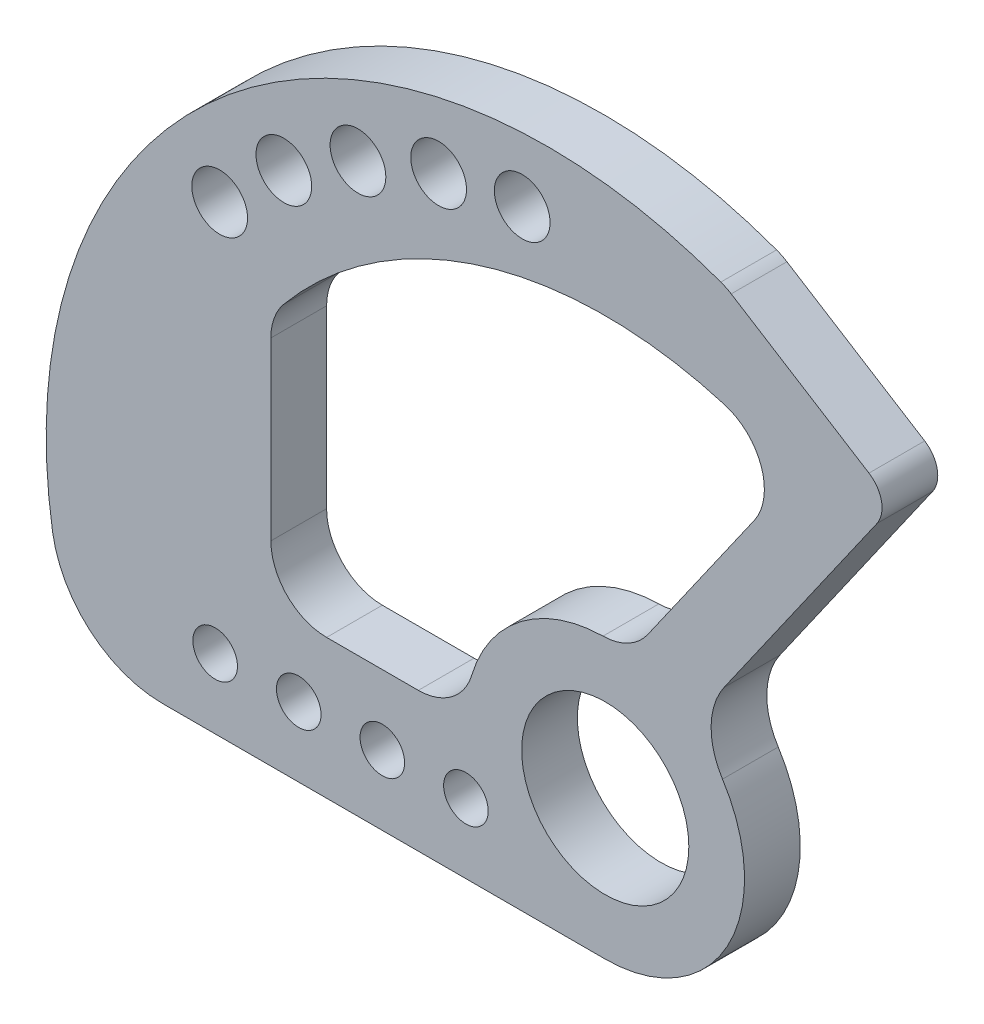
ISO-10303-21;
HEADER;
FILE_DESCRIPTION(('STEP AP214'),'2;1');
FILE_NAME('part.step','',(''),(''),'','','');
FILE_SCHEMA(('AUTOMOTIVE_DESIGN { 1 0 10303 214 1 1 1 1 }'));
ENDSEC;
DATA;
#1=APPLICATION_CONTEXT('core data for automotive mechanical design processes');
#2=APPLICATION_PROTOCOL_DEFINITION('international standard','automotive_design',2000,#1);
#3=PRODUCT_CONTEXT('',#1,'mechanical');
#4=PRODUCT('Part','Part','',(#3));
#5=PRODUCT_RELATED_PRODUCT_CATEGORY('part','',(#4));
#6=PRODUCT_DEFINITION_FORMATION('','',#4);
#7=PRODUCT_DEFINITION_CONTEXT('part definition',#1,'design');
#8=PRODUCT_DEFINITION('design','',#6,#7);
#9=PRODUCT_DEFINITION_SHAPE('','',#8);
#10=(LENGTH_UNIT() NAMED_UNIT(*) SI_UNIT(.MILLI.,.METRE.));
#11=(NAMED_UNIT(*) PLANE_ANGLE_UNIT() SI_UNIT($,.RADIAN.));
#12=(NAMED_UNIT(*) SI_UNIT($,.STERADIAN.) SOLID_ANGLE_UNIT());
#13=UNCERTAINTY_MEASURE_WITH_UNIT(LENGTH_MEASURE(1.E-05),#10,'distance_accuracy_value','');
#14=(GEOMETRIC_REPRESENTATION_CONTEXT(3) GLOBAL_UNCERTAINTY_ASSIGNED_CONTEXT((#13)) GLOBAL_UNIT_ASSIGNED_CONTEXT((#10,
#11,#12)) REPRESENTATION_CONTEXT('',''));
#15=CARTESIAN_POINT('',(0.,0.,0.));
#16=DIRECTION('',(0.,0.,1.));
#17=DIRECTION('',(1.,0.,0.));
#18=AXIS2_PLACEMENT_3D('',#15,#16,#17);
#19=CARTESIAN_POINT('',(46.7163556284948,74.5760156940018,10.));
#20=DIRECTION('',(-0.530867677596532,-0.847454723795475,0.));
#21=DIRECTION('',(0.847454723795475,-0.530867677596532,0.));
#22=AXIS2_PLACEMENT_3D('',#19,#20,#21);
#23=PLANE('',#22);
#24=DIRECTION('',(-0.847454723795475,0.530867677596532,0.));
#25=VECTOR('',#24,1.);
#26=CARTESIAN_POINT('',(46.7163556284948,74.5760156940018,0.));
#27=LINE('',#26,#25);
#28=CARTESIAN_POINT('',(47.3264699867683,74.1938241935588,0.));
#29=VERTEX_POINT('',#28);
#30=CARTESIAN_POINT('',(22.6030603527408,89.6812109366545,0.));
#31=VERTEX_POINT('',#30);
#32=EDGE_CURVE('E257',#29,#31,#27,.T.);
#33=ORIENTED_EDGE('',*,*,#32,.T.);
#34=DIRECTION('',(0.,0.,-1.));
#35=VECTOR('',#34,1.);
#36=CARTESIAN_POINT('',(22.6030603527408,89.6812109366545,10.));
#37=LINE('',#36,#35);
#38=CARTESIAN_POINT('',(22.6030603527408,89.6812109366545,10.));
#39=VERTEX_POINT('',#38);
#40=EDGE_CURVE('E11',#39,#31,#37,.T.);
#41=ORIENTED_EDGE('',*,*,#40,.F.);
#42=DIRECTION('',(-0.847454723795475,0.530867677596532,0.));
#43=VECTOR('',#42,1.);
#44=CARTESIAN_POINT('',(46.7163556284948,74.5760156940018,10.));
#45=LINE('',#44,#43);
#46=CARTESIAN_POINT('',(47.3264699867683,74.1938241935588,10.));
#47=VERTEX_POINT('',#46);
#48=EDGE_CURVE('E385',#47,#39,#45,.T.);
#49=ORIENTED_EDGE('',*,*,#48,.F.);
#50=DIRECTION('',(0.,0.,-1.));
#51=VECTOR('',#50,1.);
#52=CARTESIAN_POINT('',(47.3264699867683,74.1938241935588,10.));
#53=LINE('',#52,#51);
#54=EDGE_CURVE('E279',#47,#29,#53,.T.);
#55=ORIENTED_EDGE('',*,*,#54,.T.);
#56=EDGE_LOOP('',(#33,#41,#49,#55));
#57=FACE_BOUND('',#56,.T.);
#58=ADVANCED_FACE('F35',(#57),#23,.F.);
#59=CARTESIAN_POINT('',(17.2943835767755,81.2066636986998,10.));
#60=DIRECTION('',(0.,0.,-1.));
#61=DIRECTION('',(-1.,0.,0.));
#62=AXIS2_PLACEMENT_3D('',#59,#60,#61);
#63=CYLINDRICAL_SURFACE('',#62,9.99999999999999);
#64=CARTESIAN_POINT('',(17.2943835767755,81.2066636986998,0.));
#65=DIRECTION('',(0.,0.,1.));
#66=DIRECTION('',(1.,0.,0.));
#67=AXIS2_PLACEMENT_3D('',#64,#65,#66);
#68=CIRCLE('',#67,9.99999999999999);
#69=CARTESIAN_POINT('',(20.7461687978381,90.5920341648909,0.));
#70=VERTEX_POINT('',#69);
#71=EDGE_CURVE('E260',#31,#70,#68,.T.);
#72=ORIENTED_EDGE('',*,*,#71,.T.);
#73=DIRECTION('',(0.,0.,-1.));
#74=VECTOR('',#73,1.);
#75=CARTESIAN_POINT('',(20.7461687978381,90.5920341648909,10.));
#76=LINE('',#75,#74);
#77=CARTESIAN_POINT('',(20.7461687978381,90.5920341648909,10.));
#78=VERTEX_POINT('',#77);
#79=EDGE_CURVE('E45',#78,#70,#76,.T.);
#80=ORIENTED_EDGE('',*,*,#79,.F.);
#81=CARTESIAN_POINT('',(17.2943835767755,81.2066636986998,10.));
#82=DIRECTION('',(0.,0.,1.));
#83=DIRECTION('',(1.,0.,0.));
#84=AXIS2_PLACEMENT_3D('',#81,#82,#83);
#85=CIRCLE('',#84,9.99999999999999);
#86=EDGE_CURVE('E387',#39,#78,#85,.T.);
#87=ORIENTED_EDGE('',*,*,#86,.F.);
#88=ORIENTED_EDGE('',*,*,#40,.T.);
#89=EDGE_LOOP('',(#72,#80,#87,#88));
#90=FACE_BOUND('',#89,.T.);
#91=ADVANCED_FACE('F421',(#90),#63,.T.);
#92=CARTESIAN_POINT('',(-10.3198981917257,6.12369996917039,10.));
#93=DIRECTION('',(0.,0.,-1.));
#94=DIRECTION('',(-1.,0.,0.));
#95=AXIS2_PLACEMENT_3D('',#92,#93,#94);
#96=CYLINDRICAL_SURFACE('',#95,90.);
#97=CARTESIAN_POINT('',(-10.3198981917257,6.12369996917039,0.));
#98=DIRECTION('',(0.,0.,1.));
#99=DIRECTION('',(1.,0.,0.));
#100=AXIS2_PLACEMENT_3D('',#97,#98,#99);
#101=CIRCLE('',#100,90.);
#102=CARTESIAN_POINT('',(-99.176274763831,-8.17819999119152,0.));
#103=VERTEX_POINT('',#102);
#104=EDGE_CURVE('E262',#70,#103,#101,.T.);
#105=ORIENTED_EDGE('',*,*,#104,.T.);
#106=DIRECTION('',(0.,0.,-1.));
#107=VECTOR('',#106,1.);
#108=CARTESIAN_POINT('',(-99.176274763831,-8.17819999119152,10.));
#109=LINE('',#108,#107);
#110=CARTESIAN_POINT('',(-99.176274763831,-8.17819999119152,10.));
#111=VERTEX_POINT('',#110);
#112=EDGE_CURVE('E287',#111,#103,#109,.T.);
#113=ORIENTED_EDGE('',*,*,#112,.F.);
#114=CARTESIAN_POINT('',(-10.3198981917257,6.12369996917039,10.));
#115=DIRECTION('',(0.,0.,1.));
#116=DIRECTION('',(1.,0.,0.));
#117=AXIS2_PLACEMENT_3D('',#114,#115,#116);
#118=CIRCLE('',#117,90.);
#119=EDGE_CURVE('E389',#78,#111,#118,.T.);
#120=ORIENTED_EDGE('',*,*,#119,.F.);
#121=ORIENTED_EDGE('',*,*,#79,.T.);
#122=EDGE_LOOP('',(#105,#113,#120,#121));
#123=FACE_BOUND('',#122,.T.);
#124=ADVANCED_FACE('F427',(#123),#96,.T.);
#125=CARTESIAN_POINT('',(-79.4304133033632,-5.00000000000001,10.));
#126=DIRECTION('',(0.,0.,-1.));
#127=DIRECTION('',(-1.,0.,0.));
#128=AXIS2_PLACEMENT_3D('',#125,#126,#127);
#129=CYLINDRICAL_SURFACE('',#128,20.);
#130=CARTESIAN_POINT('',(-79.4304133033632,-5.00000000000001,0.));
#131=DIRECTION('',(0.,0.,1.));
#132=DIRECTION('',(1.,0.,0.));
#133=AXIS2_PLACEMENT_3D('',#130,#131,#132);
#134=CIRCLE('',#133,20.);
#135=CARTESIAN_POINT('',(-79.4304133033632,-25.,0.));
#136=VERTEX_POINT('',#135);
#137=EDGE_CURVE('E264',#103,#136,#134,.T.);
#138=ORIENTED_EDGE('',*,*,#137,.T.);
#139=DIRECTION('',(0.,0.,-1.));
#140=VECTOR('',#139,1.);
#141=CARTESIAN_POINT('',(-79.4304133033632,-25.,10.));
#142=LINE('',#141,#140);
#143=CARTESIAN_POINT('',(-79.4304133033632,-25.,10.));
#144=VERTEX_POINT('',#143);
#145=EDGE_CURVE('E285',#144,#136,#142,.T.);
#146=ORIENTED_EDGE('',*,*,#145,.F.);
#147=CARTESIAN_POINT('',(-79.4304133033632,-5.00000000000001,10.));
#148=DIRECTION('',(0.,0.,1.));
#149=DIRECTION('',(1.,0.,0.));
#150=AXIS2_PLACEMENT_3D('',#147,#148,#149);
#151=CIRCLE('',#150,20.);
#152=EDGE_CURVE('E391',#111,#144,#151,.T.);
#153=ORIENTED_EDGE('',*,*,#152,.F.);
#154=ORIENTED_EDGE('',*,*,#112,.T.);
#155=EDGE_LOOP('',(#138,#146,#153,#154));
#156=FACE_BOUND('',#155,.T.);
#157=ADVANCED_FACE('F403',(#156),#129,.T.);
#158=CARTESIAN_POINT('',(0.,-25.,10.));
#159=DIRECTION('',(0.,-1.,0.));
#160=DIRECTION('',(1.,0.,0.));
#161=AXIS2_PLACEMENT_3D('',#158,#159,#160);
#162=PLANE('',#161);
#163=DIRECTION('',(-1.,0.,0.));
#164=VECTOR('',#163,1.);
#165=CARTESIAN_POINT('',(0.,-25.,0.));
#166=LINE('',#165,#164);
#167=CARTESIAN_POINT('',(0.,-25.,0.));
#168=VERTEX_POINT('',#167);
#169=EDGE_CURVE('E267',#168,#136,#166,.T.);
#170=ORIENTED_EDGE('',*,*,#169,.F.);
#171=DIRECTION('',(0.,0.,-1.));
#172=VECTOR('',#171,1.);
#173=CARTESIAN_POINT('',(0.,-25.,10.));
#174=LINE('',#173,#172);
#175=CARTESIAN_POINT('',(0.,-25.,10.));
#176=VERTEX_POINT('',#175);
#177=EDGE_CURVE('E283',#176,#168,#174,.T.);
#178=ORIENTED_EDGE('',*,*,#177,.F.);
#179=DIRECTION('',(-1.,0.,0.));
#180=VECTOR('',#179,1.);
#181=CARTESIAN_POINT('',(0.,-25.,10.));
#182=LINE('',#181,#180);
#183=EDGE_CURVE('E393',#176,#144,#182,.T.);
#184=ORIENTED_EDGE('',*,*,#183,.T.);
#185=ORIENTED_EDGE('',*,*,#145,.T.);
#186=EDGE_LOOP('',(#170,#178,#184,#185));
#187=FACE_BOUND('',#186,.T.);
#188=ADVANCED_FACE('F397',(#187),#162,.T.);
#189=CARTESIAN_POINT('',(0.,0.,10.));
#190=DIRECTION('',(0.,0.,-1.));
#191=DIRECTION('',(-1.,0.,0.));
#192=AXIS2_PLACEMENT_3D('',#189,#190,#191);
#193=CYLINDRICAL_SURFACE('',#192,25.);
#194=CARTESIAN_POINT('',(0.,0.,0.));
#195=DIRECTION('',(0.,0.,1.));
#196=DIRECTION('',(1.,0.,0.));
#197=AXIS2_PLACEMENT_3D('',#194,#195,#196);
#198=CIRCLE('',#197,25.);
#199=CARTESIAN_POINT('',(21.0450044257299,13.4947318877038,0.));
#200=VERTEX_POINT('',#199);
#201=EDGE_CURVE('E270',#168,#200,#198,.T.);
#202=ORIENTED_EDGE('',*,*,#201,.T.);
#203=DIRECTION('',(0.,0.,-1.));
#204=VECTOR('',#203,1.);
#205=CARTESIAN_POINT('',(21.0450044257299,13.4947318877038,10.));
#206=LINE('',#205,#204);
#207=CARTESIAN_POINT('',(21.0450044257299,13.4947318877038,10.));
#208=VERTEX_POINT('',#207);
#209=EDGE_CURVE('E195',#208,#200,#206,.T.);
#210=ORIENTED_EDGE('',*,*,#209,.F.);
#211=CARTESIAN_POINT('',(0.,0.,10.));
#212=DIRECTION('',(0.,0.,1.));
#213=DIRECTION('',(1.,0.,0.));
#214=AXIS2_PLACEMENT_3D('',#211,#212,#213);
#215=CIRCLE('',#214,25.);
#216=EDGE_CURVE('E186',#176,#208,#215,.T.);
#217=ORIENTED_EDGE('',*,*,#216,.F.);
#218=ORIENTED_EDGE('',*,*,#177,.T.);
#219=EDGE_LOOP('',(#202,#210,#217,#218));
#220=FACE_BOUND('',#219,.T.);
#221=ADVANCED_FACE('F411',(#220),#193,.T.);
#222=CARTESIAN_POINT('',(31.948131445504,20.4861666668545,10.));
#223=DIRECTION('',(0.,0.,-1.));
#224=DIRECTION('',(-1.,0.,0.));
#225=AXIS2_PLACEMENT_3D('',#222,#223,#224);
#226=CYLINDRICAL_SURFACE('',#225,12.9521557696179);
#227=CARTESIAN_POINT('',(31.948131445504,20.4861666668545,0.));
#228=DIRECTION('',(0.,0.,1.));
#229=DIRECTION('',(1.,0.,0.));
#230=AXIS2_PLACEMENT_3D('',#227,#228,#229);
#231=CIRCLE('',#230,12.9521557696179);
#232=CARTESIAN_POINT('',(21.338346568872,27.9152180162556,0.));
#233=VERTEX_POINT('',#232);
#234=EDGE_CURVE('E194',#200,#233,#231,.F.);
#235=ORIENTED_EDGE('',*,*,#234,.T.);
#236=DIRECTION('',(0.,0.,-1.));
#237=VECTOR('',#236,1.);
#238=CARTESIAN_POINT('',(21.338346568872,27.9152180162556,10.));
#239=LINE('',#238,#237);
#240=CARTESIAN_POINT('',(21.338346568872,27.9152180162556,10.));
#241=VERTEX_POINT('',#240);
#242=EDGE_CURVE('E191',#241,#233,#239,.T.);
#243=ORIENTED_EDGE('',*,*,#242,.F.);
#244=CARTESIAN_POINT('',(31.948131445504,20.4861666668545,10.));
#245=DIRECTION('',(0.,0.,1.));
#246=DIRECTION('',(1.,0.,0.));
#247=AXIS2_PLACEMENT_3D('',#244,#245,#246);
#248=CIRCLE('',#247,12.9521557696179);
#249=EDGE_CURVE('E178',#208,#241,#248,.F.);
#250=ORIENTED_EDGE('',*,*,#249,.F.);
#251=ORIENTED_EDGE('',*,*,#209,.T.);
#252=EDGE_LOOP('',(#235,#243,#250,#251));
#253=FACE_BOUND('',#252,.T.);
#254=ADVANCED_FACE('F192',(#253),#226,.F.);
#255=CARTESIAN_POINT('',(1.20238327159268,-0.841917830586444,10.));
#256=DIRECTION('',(-0.819152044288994,0.573576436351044,0.));
#257=DIRECTION('',(-0.573576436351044,-0.819152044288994,0.));
#258=AXIS2_PLACEMENT_3D('',#255,#256,#257);
#259=PLANE('',#258);
#260=DIRECTION('',(0.573576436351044,0.819152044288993,0.));
#261=VECTOR('',#260,1.);
#262=CARTESIAN_POINT('',(1.20238327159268,-0.841917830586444,0.));
#263=LINE('',#262,#261);
#264=CARTESIAN_POINT('',(48.7678918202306,67.0886683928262,0.));
#265=VERTEX_POINT('',#264);
#266=EDGE_CURVE('E116',#233,#265,#263,.T.);
#267=ORIENTED_EDGE('',*,*,#266,.T.);
#268=DIRECTION('',(0.,0.,-1.));
#269=VECTOR('',#268,1.);
#270=CARTESIAN_POINT('',(48.7678918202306,67.0886683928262,10.));
#271=LINE('',#270,#269);
#272=CARTESIAN_POINT('',(48.7678918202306,67.0886683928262,10.));
#273=VERTEX_POINT('',#272);
#274=EDGE_CURVE('E196',#273,#265,#271,.T.);
#275=ORIENTED_EDGE('',*,*,#274,.F.);
#276=DIRECTION('',(0.573576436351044,0.819152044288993,0.));
#277=VECTOR('',#276,1.);
#278=CARTESIAN_POINT('',(1.20238327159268,-0.841917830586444,10.));
#279=LINE('',#278,#277);
#280=EDGE_CURVE('E183',#241,#273,#279,.T.);
#281=ORIENTED_EDGE('',*,*,#280,.F.);
#282=ORIENTED_EDGE('',*,*,#242,.T.);
#283=EDGE_LOOP('',(#267,#275,#281,#282));
#284=FACE_BOUND('',#283,.T.);
#285=ADVANCED_FACE('F198',(#284),#259,.F.);
#286=CARTESIAN_POINT('',(-0.561025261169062,34.9955032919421,10.));
#287=DIRECTION('',(0.,0.,-1.));
#288=DIRECTION('',(-1.,0.,0.));
#289=AXIS2_PLACEMENT_3D('',#286,#287,#288);
#290=CYLINDRICAL_SURFACE('',#289,9.99999999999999);
#291=CARTESIAN_POINT('',(-0.561025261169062,34.9955032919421,0.));
#292=DIRECTION('',(0.,0.,1.));
#293=DIRECTION('',(1.,0.,0.));
#294=AXIS2_PLACEMENT_3D('',#291,#292,#293);
#295=CIRCLE('',#294,9.99999999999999);
#296=CARTESIAN_POINT('',(7.63049518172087,29.2597389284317,0.));
#297=VERTEX_POINT('',#296);
#298=CARTESIAN_POINT('',(-0.400732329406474,24.9967880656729,0.));
#299=VERTEX_POINT('',#298);
#300=EDGE_CURVE('E207',#297,#299,#295,.F.);
#301=ORIENTED_EDGE('',*,*,#300,.T.);
#302=DIRECTION('',(0.,0.,-1.));
#303=VECTOR('',#302,1.);
#304=CARTESIAN_POINT('',(-0.400732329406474,24.9967880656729,10.));
#305=LINE('',#304,#303);
#306=CARTESIAN_POINT('',(-0.400732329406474,24.9967880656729,10.));
#307=VERTEX_POINT('',#306);
#308=EDGE_CURVE('E39',#307,#299,#305,.T.);
#309=ORIENTED_EDGE('',*,*,#308,.F.);
#310=CARTESIAN_POINT('',(-0.561025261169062,34.9955032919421,10.));
#311=DIRECTION('',(0.,0.,1.));
#312=DIRECTION('',(1.,0.,0.));
#313=AXIS2_PLACEMENT_3D('',#310,#311,#312);
#314=CIRCLE('',#313,9.99999999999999);
#315=CARTESIAN_POINT('',(7.63049518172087,29.2597389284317,10.));
#316=VERTEX_POINT('',#315);
#317=EDGE_CURVE('E278',#316,#307,#314,.F.);
#318=ORIENTED_EDGE('',*,*,#317,.F.);
#319=DIRECTION('',(0.,0.,-1.));
#320=VECTOR('',#319,1.);
#321=CARTESIAN_POINT('',(7.63049518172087,29.2597389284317,10.));
#322=LINE('',#321,#320);
#323=EDGE_CURVE('E206',#316,#297,#322,.T.);
#324=ORIENTED_EDGE('',*,*,#323,.T.);
#325=EDGE_LOOP('',(#301,#309,#318,#324));
#326=FACE_BOUND('',#325,.T.);
#327=ADVANCED_FACE('F37',(#326),#290,.F.);
#328=CARTESIAN_POINT('',(0.,0.,10.));
#329=DIRECTION('',(0.,0.,-1.));
#330=DIRECTION('',(-1.,0.,0.));
#331=AXIS2_PLACEMENT_3D('',#328,#329,#330);
#332=CYLINDRICAL_SURFACE('',#331,25.);
#333=CARTESIAN_POINT('',(0.,0.,0.));
#334=DIRECTION('',(0.,0.,1.));
#335=DIRECTION('',(1.,0.,0.));
#336=AXIS2_PLACEMENT_3D('',#333,#334,#335);
#337=CIRCLE('',#336,25.);
#338=CARTESIAN_POINT('',(-23.9578711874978,7.14285714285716,0.));
#339=VERTEX_POINT('',#338);
#340=EDGE_CURVE('E210',#299,#339,#337,.T.);
#341=ORIENTED_EDGE('',*,*,#340,.T.);
#342=DIRECTION('',(0.,0.,-1.));
#343=VECTOR('',#342,1.);
#344=CARTESIAN_POINT('',(-23.9578711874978,7.14285714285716,10.));
#345=LINE('',#344,#343);
#346=CARTESIAN_POINT('',(-23.9578711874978,7.14285714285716,10.));
#347=VERTEX_POINT('',#346);
#348=EDGE_CURVE('E313',#347,#339,#345,.T.);
#349=ORIENTED_EDGE('',*,*,#348,.F.);
#350=CARTESIAN_POINT('',(0.,0.,10.));
#351=DIRECTION('',(0.,0.,1.));
#352=DIRECTION('',(1.,0.,0.));
#353=AXIS2_PLACEMENT_3D('',#350,#351,#352);
#354=CIRCLE('',#353,25.);
#355=EDGE_CURVE('E131',#307,#347,#354,.T.);
#356=ORIENTED_EDGE('',*,*,#355,.F.);
#357=ORIENTED_EDGE('',*,*,#308,.T.);
#358=EDGE_LOOP('',(#341,#349,#356,#357));
#359=FACE_BOUND('',#358,.T.);
#360=ADVANCED_FACE('F318',(#359),#332,.T.);
#361=CARTESIAN_POINT('',(-33.5410196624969,10.,10.));
#362=DIRECTION('',(0.,0.,-1.));
#363=DIRECTION('',(-1.,0.,0.));
#364=AXIS2_PLACEMENT_3D('',#361,#362,#363);
#365=CYLINDRICAL_SURFACE('',#364,10.);
#366=CARTESIAN_POINT('',(-33.5410196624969,10.,0.));
#367=DIRECTION('',(0.,0.,1.));
#368=DIRECTION('',(1.,0.,0.));
#369=AXIS2_PLACEMENT_3D('',#366,#367,#368);
#370=CIRCLE('',#369,10.);
#371=CARTESIAN_POINT('',(-33.5410196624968,0.,0.));
#372=VERTEX_POINT('',#371);
#373=EDGE_CURVE('E213',#372,#339,#370,.T.);
#374=ORIENTED_EDGE('',*,*,#373,.F.);
#375=DIRECTION('',(0.,0.,-1.));
#376=VECTOR('',#375,1.);
#377=CARTESIAN_POINT('',(-33.5410196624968,0.,10.));
#378=LINE('',#377,#376);
#379=CARTESIAN_POINT('',(-33.5410196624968,0.,10.));
#380=VERTEX_POINT('',#379);
#381=EDGE_CURVE('E312',#380,#372,#378,.T.);
#382=ORIENTED_EDGE('',*,*,#381,.F.);
#383=CARTESIAN_POINT('',(-33.5410196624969,10.,10.));
#384=DIRECTION('',(0.,0.,1.));
#385=DIRECTION('',(1.,0.,0.));
#386=AXIS2_PLACEMENT_3D('',#383,#384,#385);
#387=CIRCLE('',#386,10.);
#388=EDGE_CURVE('E333',#380,#347,#387,.T.);
#389=ORIENTED_EDGE('',*,*,#388,.T.);
#390=ORIENTED_EDGE('',*,*,#348,.T.);
#391=EDGE_LOOP('',(#374,#382,#389,#390));
#392=FACE_BOUND('',#391,.T.);
#393=ADVANCED_FACE('F330',(#392),#365,.F.);
#394=CARTESIAN_POINT('',(0.,0.,10.));
#395=DIRECTION('',(0.,-1.,0.));
#396=DIRECTION('',(1.,0.,0.));
#397=AXIS2_PLACEMENT_3D('',#394,#395,#396);
#398=PLANE('',#397);
#399=DIRECTION('',(-1.,0.,0.));
#400=VECTOR('',#399,1.);
#401=CARTESIAN_POINT('',(0.,0.,0.));
#402=LINE('',#401,#400);
#403=CARTESIAN_POINT('',(-50.,0.,0.));
#404=VERTEX_POINT('',#403);
#405=EDGE_CURVE('E216',#372,#404,#402,.T.);
#406=ORIENTED_EDGE('',*,*,#405,.T.);
#407=DIRECTION('',(0.,0.,-1.));
#408=VECTOR('',#407,1.);
#409=CARTESIAN_POINT('',(-50.,0.,10.));
#410=LINE('',#409,#408);
#411=CARTESIAN_POINT('',(-50.,0.,10.));
#412=VERTEX_POINT('',#411);
#413=EDGE_CURVE('E309',#412,#404,#410,.T.);
#414=ORIENTED_EDGE('',*,*,#413,.F.);
#415=DIRECTION('',(-1.,0.,0.));
#416=VECTOR('',#415,1.);
#417=CARTESIAN_POINT('',(0.,0.,10.));
#418=LINE('',#417,#416);
#419=EDGE_CURVE('E336',#380,#412,#418,.T.);
#420=ORIENTED_EDGE('',*,*,#419,.F.);
#421=ORIENTED_EDGE('',*,*,#381,.T.);
#422=EDGE_LOOP('',(#406,#414,#420,#421));
#423=FACE_BOUND('',#422,.T.);
#424=ADVANCED_FACE('F337',(#423),#398,.F.);
#425=CARTESIAN_POINT('',(-50.,10.,10.));
#426=DIRECTION('',(0.,0.,-1.));
#427=DIRECTION('',(-1.,0.,0.));
#428=AXIS2_PLACEMENT_3D('',#425,#426,#427);
#429=CYLINDRICAL_SURFACE('',#428,10.);
#430=CARTESIAN_POINT('',(-50.,10.,0.));
#431=DIRECTION('',(0.,0.,1.));
#432=DIRECTION('',(1.,0.,0.));
#433=AXIS2_PLACEMENT_3D('',#430,#431,#432);
#434=CIRCLE('',#433,10.);
#435=CARTESIAN_POINT('',(-60.,10.,0.));
#436=VERTEX_POINT('',#435);
#437=EDGE_CURVE('E218',#404,#436,#434,.F.);
#438=ORIENTED_EDGE('',*,*,#437,.T.);
#439=DIRECTION('',(0.,0.,-1.));
#440=VECTOR('',#439,1.);
#441=CARTESIAN_POINT('',(-60.,10.,10.));
#442=LINE('',#441,#440);
#443=CARTESIAN_POINT('',(-60.,10.,10.));
#444=VERTEX_POINT('',#443);
#445=EDGE_CURVE('E306',#444,#436,#442,.T.);
#446=ORIENTED_EDGE('',*,*,#445,.F.);
#447=CARTESIAN_POINT('',(-50.,10.,10.));
#448=DIRECTION('',(0.,0.,1.));
#449=DIRECTION('',(1.,0.,0.));
#450=AXIS2_PLACEMENT_3D('',#447,#448,#449);
#451=CIRCLE('',#450,10.);
#452=EDGE_CURVE('E340',#412,#444,#451,.F.);
#453=ORIENTED_EDGE('',*,*,#452,.F.);
#454=ORIENTED_EDGE('',*,*,#413,.T.);
#455=EDGE_LOOP('',(#438,#446,#453,#454));
#456=FACE_BOUND('',#455,.T.);
#457=ADVANCED_FACE('F489',(#456),#429,.F.);
#458=CARTESIAN_POINT('',(-60.,0.,10.));
#459=DIRECTION('',(-1.,0.,0.));
#460=DIRECTION('',(0.,0.,1.));
#461=AXIS2_PLACEMENT_3D('',#458,#459,#460);
#462=PLANE('',#461);
#463=DIRECTION('',(0.,1.,0.));
#464=VECTOR('',#463,1.);
#465=CARTESIAN_POINT('',(-60.,0.,0.));
#466=LINE('',#465,#464);
#467=CARTESIAN_POINT('',(-60.,41.5331193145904,0.));
#468=VERTEX_POINT('',#467);
#469=EDGE_CURVE('E220',#436,#468,#466,.T.);
#470=ORIENTED_EDGE('',*,*,#469,.T.);
#471=DIRECTION('',(0.,0.,-1.));
#472=VECTOR('',#471,1.);
#473=CARTESIAN_POINT('',(-60.,41.5331193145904,10.));
#474=LINE('',#473,#472);
#475=CARTESIAN_POINT('',(-60.,41.5331193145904,10.));
#476=VERTEX_POINT('',#475);
#477=EDGE_CURVE('E303',#476,#468,#474,.T.);
#478=ORIENTED_EDGE('',*,*,#477,.F.);
#479=DIRECTION('',(0.,1.,0.));
#480=VECTOR('',#479,1.);
#481=CARTESIAN_POINT('',(-60.,0.,10.));
#482=LINE('',#481,#480);
#483=EDGE_CURVE('E348',#444,#476,#482,.T.);
#484=ORIENTED_EDGE('',*,*,#483,.F.);
#485=ORIENTED_EDGE('',*,*,#445,.T.);
#486=EDGE_LOOP('',(#470,#478,#484,#485));
#487=FACE_BOUND('',#486,.T.);
#488=ADVANCED_FACE('F485',(#487),#462,.F.);
#489=CARTESIAN_POINT('',(-50.,41.5331193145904,10.));
#490=DIRECTION('',(0.,0.,-1.));
#491=DIRECTION('',(-1.,0.,0.));
#492=AXIS2_PLACEMENT_3D('',#489,#490,#491);
#493=CYLINDRICAL_SURFACE('',#492,9.99999999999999);
#494=CARTESIAN_POINT('',(-50.,41.5331193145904,0.));
#495=DIRECTION('',(0.,0.,1.));
#496=DIRECTION('',(1.,0.,0.));
#497=AXIS2_PLACEMENT_3D('',#494,#495,#496);
#498=CIRCLE('',#497,9.99999999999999);
#499=CARTESIAN_POINT('',(-57.6923076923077,47.9228299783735,0.));
#500=VERTEX_POINT('',#499);
#501=EDGE_CURVE('E222',#468,#500,#498,.F.);
#502=ORIENTED_EDGE('',*,*,#501,.T.);
#503=DIRECTION('',(0.,0.,-1.));
#504=VECTOR('',#503,1.);
#505=CARTESIAN_POINT('',(-57.6923076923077,47.9228299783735,10.));
#506=LINE('',#505,#504);
#507=CARTESIAN_POINT('',(-57.6923076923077,47.9228299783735,10.));
#508=VERTEX_POINT('',#507);
#509=EDGE_CURVE('E300',#508,#500,#506,.T.);
#510=ORIENTED_EDGE('',*,*,#509,.F.);
#511=CARTESIAN_POINT('',(-50.,41.5331193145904,10.));
#512=DIRECTION('',(0.,0.,1.));
#513=DIRECTION('',(1.,0.,0.));
#514=AXIS2_PLACEMENT_3D('',#511,#512,#513);
#515=CIRCLE('',#514,9.99999999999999);
#516=EDGE_CURVE('E350',#476,#508,#515,.F.);
#517=ORIENTED_EDGE('',*,*,#516,.F.);
#518=ORIENTED_EDGE('',*,*,#477,.T.);
#519=EDGE_LOOP('',(#502,#510,#517,#518));
#520=FACE_BOUND('',#519,.T.);
#521=ADVANCED_FACE('F481',(#520),#493,.F.);
#522=CARTESIAN_POINT('',(0.,0.,10.));
#523=DIRECTION('',(0.,0.,-1.));
#524=DIRECTION('',(-1.,0.,0.));
#525=AXIS2_PLACEMENT_3D('',#522,#523,#524);
#526=CYLINDRICAL_SURFACE('',#525,75.);
#527=CARTESIAN_POINT('',(0.,0.,0.));
#528=DIRECTION('',(0.,0.,1.));
#529=DIRECTION('',(1.,0.,0.));
#530=AXIS2_PLACEMENT_3D('',#527,#528,#529);
#531=CIRCLE('',#530,75.);
#532=CARTESIAN_POINT('',(21.4091769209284,71.8793930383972,0.));
#533=VERTEX_POINT('',#532);
#534=EDGE_CURVE('E224',#500,#533,#531,.F.);
#535=ORIENTED_EDGE('',*,*,#534,.T.);
#536=DIRECTION('',(0.,0.,-1.));
#537=VECTOR('',#536,1.);
#538=CARTESIAN_POINT('',(21.4091769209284,71.8793930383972,10.));
#539=LINE('',#538,#537);
#540=CARTESIAN_POINT('',(21.4091769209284,71.8793930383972,10.));
#541=VERTEX_POINT('',#540);
#542=EDGE_CURVE('E297',#541,#533,#539,.T.);
#543=ORIENTED_EDGE('',*,*,#542,.F.);
#544=CARTESIAN_POINT('',(0.,0.,10.));
#545=DIRECTION('',(0.,0.,1.));
#546=DIRECTION('',(1.,0.,0.));
#547=AXIS2_PLACEMENT_3D('',#544,#545,#546);
#548=CIRCLE('',#547,75.);
#549=EDGE_CURVE('E352',#508,#541,#548,.F.);
#550=ORIENTED_EDGE('',*,*,#549,.F.);
#551=ORIENTED_EDGE('',*,*,#509,.T.);
#552=EDGE_LOOP('',(#535,#543,#550,#551));
#553=FACE_BOUND('',#552,.T.);
#554=ADVANCED_FACE('F477',(#553),#526,.F.);
#555=CARTESIAN_POINT('',(18.5546199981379,62.2954739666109,10.));
#556=DIRECTION('',(0.,0.,-1.));
#557=DIRECTION('',(-1.,0.,0.));
#558=AXIS2_PLACEMENT_3D('',#555,#556,#557);
#559=CYLINDRICAL_SURFACE('',#558,9.99999999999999);
#560=CARTESIAN_POINT('',(18.5546199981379,62.2954739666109,0.));
#561=DIRECTION('',(0.,0.,1.));
#562=DIRECTION('',(1.,0.,0.));
#563=AXIS2_PLACEMENT_3D('',#560,#561,#562);
#564=CIRCLE('',#563,9.99999999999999);
#565=CARTESIAN_POINT('',(26.7461404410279,56.5597096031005,0.));
#566=VERTEX_POINT('',#565);
#567=EDGE_CURVE('E226',#533,#566,#564,.F.);
#568=ORIENTED_EDGE('',*,*,#567,.T.);
#569=DIRECTION('',(0.,0.,-1.));
#570=VECTOR('',#569,1.);
#571=CARTESIAN_POINT('',(26.7461404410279,56.5597096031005,10.));
#572=LINE('',#571,#570);
#573=CARTESIAN_POINT('',(26.7461404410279,56.5597096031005,10.));
#574=VERTEX_POINT('',#573);
#575=EDGE_CURVE('E294',#574,#566,#572,.T.);
#576=ORIENTED_EDGE('',*,*,#575,.F.);
#577=CARTESIAN_POINT('',(18.5546199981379,62.2954739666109,10.));
#578=DIRECTION('',(0.,0.,1.));
#579=DIRECTION('',(1.,0.,0.));
#580=AXIS2_PLACEMENT_3D('',#577,#578,#579);
#581=CIRCLE('',#580,9.99999999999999);
#582=EDGE_CURVE('E354',#541,#574,#581,.F.);
#583=ORIENTED_EDGE('',*,*,#582,.F.);
#584=ORIENTED_EDGE('',*,*,#542,.T.);
#585=EDGE_LOOP('',(#568,#576,#583,#584));
#586=FACE_BOUND('',#585,.T.);
#587=ADVANCED_FACE('F474',(#586),#559,.F.);
#588=CARTESIAN_POINT('',(44.6721315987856,69.9565505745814,10.));
#589=DIRECTION('',(0.,0.,-1.));
#590=DIRECTION('',(-1.,0.,0.));
#591=AXIS2_PLACEMENT_3D('',#588,#589,#590);
#592=CYLINDRICAL_SURFACE('',#591,5.);
#593=CARTESIAN_POINT('',(44.6721315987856,69.9565505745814,0.));
#594=DIRECTION('',(0.,0.,1.));
#595=DIRECTION('',(1.,0.,0.));
#596=AXIS2_PLACEMENT_3D('',#593,#594,#595);
#597=CIRCLE('',#596,5.);
#598=EDGE_CURVE('E122',#265,#29,#597,.T.);
#599=ORIENTED_EDGE('',*,*,#598,.T.);
#600=ORIENTED_EDGE('',*,*,#54,.F.);
#601=CARTESIAN_POINT('',(44.6721315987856,69.9565505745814,10.));
#602=DIRECTION('',(0.,0.,1.));
#603=DIRECTION('',(1.,0.,0.));
#604=AXIS2_PLACEMENT_3D('',#601,#602,#603);
#605=CIRCLE('',#604,5.);
#606=EDGE_CURVE('E54',#273,#47,#605,.T.);
#607=ORIENTED_EDGE('',*,*,#606,.F.);
#608=ORIENTED_EDGE('',*,*,#274,.T.);
#609=EDGE_LOOP('',(#599,#600,#607,#608));
#610=FACE_BOUND('',#609,.T.);
#611=ADVANCED_FACE('F436',(#610),#592,.T.);
#612=CARTESIAN_POINT('',(-25.,-12.5,10.));
#613=DIRECTION('',(0.,0.,-1.));
#614=DIRECTION('',(-1.,0.,0.));
#615=AXIS2_PLACEMENT_3D('',#612,#613,#614);
#616=CYLINDRICAL_SURFACE('',#615,4.00000000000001);
#617=CARTESIAN_POINT('',(-25.,-12.5,10.));
#618=DIRECTION('',(0.,0.,1.));
#619=DIRECTION('',(1.,0.,0.));
#620=AXIS2_PLACEMENT_3D('',#617,#618,#619);
#621=CIRCLE('',#620,4.00000000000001);
#622=CARTESIAN_POINT('',(-21.,-12.5,10.));
#623=VERTEX_POINT('',#622);
#624=EDGE_CURVE('E382',#623,#623,#621,.T.);
#625=ORIENTED_EDGE('',*,*,#624,.T.);
#626=EDGE_LOOP('',(#625));
#627=FACE_BOUND('',#626,.T.);
#628=CARTESIAN_POINT('',(-25.,-12.5,0.));
#629=DIRECTION('',(0.,0.,1.));
#630=DIRECTION('',(1.,0.,0.));
#631=AXIS2_PLACEMENT_3D('',#628,#629,#630);
#632=CIRCLE('',#631,4.00000000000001);
#633=CARTESIAN_POINT('',(-21.,-12.5,0.));
#634=VERTEX_POINT('',#633);
#635=EDGE_CURVE('E254',#634,#634,#632,.T.);
#636=ORIENTED_EDGE('',*,*,#635,.F.);
#637=EDGE_LOOP('',(#636));
#638=FACE_BOUND('',#637,.T.);
#639=ADVANCED_FACE('F432',(#627,#638),#616,.F.);
#640=CARTESIAN_POINT('',(-40.,-12.5,10.));
#641=DIRECTION('',(0.,0.,-1.));
#642=DIRECTION('',(-1.,0.,0.));
#643=AXIS2_PLACEMENT_3D('',#640,#641,#642);
#644=CYLINDRICAL_SURFACE('',#643,4.00000000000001);
#645=CARTESIAN_POINT('',(-40.,-12.5,10.));
#646=DIRECTION('',(0.,0.,1.));
#647=DIRECTION('',(1.,0.,0.));
#648=AXIS2_PLACEMENT_3D('',#645,#646,#647);
#649=CIRCLE('',#648,4.00000000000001);
#650=CARTESIAN_POINT('',(-36.,-12.5,10.));
#651=VERTEX_POINT('',#650);
#652=EDGE_CURVE('E379',#651,#651,#649,.T.);
#653=ORIENTED_EDGE('',*,*,#652,.T.);
#654=EDGE_LOOP('',(#653));
#655=FACE_BOUND('',#654,.T.);
#656=CARTESIAN_POINT('',(-40.,-12.5,0.));
#657=DIRECTION('',(0.,0.,1.));
#658=DIRECTION('',(1.,0.,0.));
#659=AXIS2_PLACEMENT_3D('',#656,#657,#658);
#660=CIRCLE('',#659,4.00000000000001);
#661=CARTESIAN_POINT('',(-36.,-12.5,0.));
#662=VERTEX_POINT('',#661);
#663=EDGE_CURVE('E251',#662,#662,#660,.T.);
#664=ORIENTED_EDGE('',*,*,#663,.F.);
#665=EDGE_LOOP('',(#664));
#666=FACE_BOUND('',#665,.T.);
#667=ADVANCED_FACE('F435',(#655,#666),#644,.F.);
#668=CARTESIAN_POINT('',(-55.,-12.5,10.));
#669=DIRECTION('',(0.,0.,-1.));
#670=DIRECTION('',(-1.,0.,0.));
#671=AXIS2_PLACEMENT_3D('',#668,#669,#670);
#672=CYLINDRICAL_SURFACE('',#671,4.00000000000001);
#673=CARTESIAN_POINT('',(-55.,-12.5,10.));
#674=DIRECTION('',(0.,0.,1.));
#675=DIRECTION('',(1.,0.,0.));
#676=AXIS2_PLACEMENT_3D('',#673,#674,#675);
#677=CIRCLE('',#676,4.00000000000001);
#678=CARTESIAN_POINT('',(-51.,-12.5,10.));
#679=VERTEX_POINT('',#678);
#680=EDGE_CURVE('E376',#679,#679,#677,.T.);
#681=ORIENTED_EDGE('',*,*,#680,.T.);
#682=EDGE_LOOP('',(#681));
#683=FACE_BOUND('',#682,.T.);
#684=CARTESIAN_POINT('',(-55.,-12.5,0.));
#685=DIRECTION('',(0.,0.,1.));
#686=DIRECTION('',(1.,0.,0.));
#687=AXIS2_PLACEMENT_3D('',#684,#685,#686);
#688=CIRCLE('',#687,4.00000000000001);
#689=CARTESIAN_POINT('',(-51.,-12.5,0.));
#690=VERTEX_POINT('',#689);
#691=EDGE_CURVE('E248',#690,#690,#688,.T.);
#692=ORIENTED_EDGE('',*,*,#691,.F.);
#693=EDGE_LOOP('',(#692));
#694=FACE_BOUND('',#693,.T.);
#695=ADVANCED_FACE('F440',(#683,#694),#672,.F.);
#696=CARTESIAN_POINT('',(-70.,-12.5,10.));
#697=DIRECTION('',(0.,0.,-1.));
#698=DIRECTION('',(-1.,0.,0.));
#699=AXIS2_PLACEMENT_3D('',#696,#697,#698);
#700=CYLINDRICAL_SURFACE('',#699,4.00000000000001);
#701=CARTESIAN_POINT('',(-70.,-12.5,10.));
#702=DIRECTION('',(0.,0.,1.));
#703=DIRECTION('',(1.,0.,0.));
#704=AXIS2_PLACEMENT_3D('',#701,#702,#703);
#705=CIRCLE('',#704,4.00000000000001);
#706=CARTESIAN_POINT('',(-66.,-12.5,10.));
#707=VERTEX_POINT('',#706);
#708=EDGE_CURVE('E373',#707,#707,#705,.T.);
#709=ORIENTED_EDGE('',*,*,#708,.T.);
#710=EDGE_LOOP('',(#709));
#711=FACE_BOUND('',#710,.T.);
#712=CARTESIAN_POINT('',(-70.,-12.5,0.));
#713=DIRECTION('',(0.,0.,1.));
#714=DIRECTION('',(1.,0.,0.));
#715=AXIS2_PLACEMENT_3D('',#712,#713,#714);
#716=CIRCLE('',#715,4.00000000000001);
#717=CARTESIAN_POINT('',(-66.,-12.5,0.));
#718=VERTEX_POINT('',#717);
#719=EDGE_CURVE('E245',#718,#718,#716,.T.);
#720=ORIENTED_EDGE('',*,*,#719,.F.);
#721=EDGE_LOOP('',(#720));
#722=FACE_BOUND('',#721,.T.);
#723=ADVANCED_FACE('F444',(#711,#722),#700,.F.);
#724=CARTESIAN_POINT('',(-14.8978835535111,84.4900961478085,10.));
#725=DIRECTION('',(0.,0.,-1.));
#726=DIRECTION('',(-1.,0.,0.));
#727=AXIS2_PLACEMENT_3D('',#724,#725,#726);
#728=CYLINDRICAL_SURFACE('',#727,5.);
#729=CARTESIAN_POINT('',(-14.8978835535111,84.4900961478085,10.));
#730=DIRECTION('',(0.,0.,1.));
#731=DIRECTION('',(1.,0.,0.));
#732=AXIS2_PLACEMENT_3D('',#729,#730,#731);
#733=CIRCLE('',#732,5.);
#734=CARTESIAN_POINT('',(-9.89788355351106,84.4900961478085,10.));
#735=VERTEX_POINT('',#734);
#736=EDGE_CURVE('E370',#735,#735,#733,.T.);
#737=ORIENTED_EDGE('',*,*,#736,.T.);
#738=EDGE_LOOP('',(#737));
#739=FACE_BOUND('',#738,.T.);
#740=CARTESIAN_POINT('',(-14.8978835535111,84.4900961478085,0.));
#741=DIRECTION('',(0.,0.,1.));
#742=DIRECTION('',(1.,0.,0.));
#743=AXIS2_PLACEMENT_3D('',#740,#741,#742);
#744=CIRCLE('',#743,5.);
#745=CARTESIAN_POINT('',(-9.89788355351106,84.4900961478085,0.));
#746=VERTEX_POINT('',#745);
#747=EDGE_CURVE('E242',#746,#746,#744,.T.);
#748=ORIENTED_EDGE('',*,*,#747,.F.);
#749=EDGE_LOOP('',(#748));
#750=FACE_BOUND('',#749,.T.);
#751=ADVANCED_FACE('F448',(#739,#750),#728,.F.);
#752=CARTESIAN_POINT('',(-29.8976711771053,82.1431764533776,10.));
#753=DIRECTION('',(0.,0.,-1.));
#754=DIRECTION('',(-1.,0.,0.));
#755=AXIS2_PLACEMENT_3D('',#752,#753,#754);
#756=CYLINDRICAL_SURFACE('',#755,5.);
#757=CARTESIAN_POINT('',(-29.8976711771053,82.1431764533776,10.));
#758=DIRECTION('',(0.,0.,1.));
#759=DIRECTION('',(1.,0.,0.));
#760=AXIS2_PLACEMENT_3D('',#757,#758,#759);
#761=CIRCLE('',#760,5.);
#762=CARTESIAN_POINT('',(-24.8976711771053,82.1431764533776,10.));
#763=VERTEX_POINT('',#762);
#764=EDGE_CURVE('E367',#763,#763,#761,.T.);
#765=ORIENTED_EDGE('',*,*,#764,.T.);
#766=EDGE_LOOP('',(#765));
#767=FACE_BOUND('',#766,.T.);
#768=CARTESIAN_POINT('',(-29.8976711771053,82.1431764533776,0.));
#769=DIRECTION('',(0.,0.,1.));
#770=DIRECTION('',(1.,0.,0.));
#771=AXIS2_PLACEMENT_3D('',#768,#769,#770);
#772=CIRCLE('',#771,5.);
#773=CARTESIAN_POINT('',(-24.8976711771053,82.1431764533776,0.));
#774=VERTEX_POINT('',#773);
#775=EDGE_CURVE('E239',#774,#774,#772,.T.);
#776=ORIENTED_EDGE('',*,*,#775,.F.);
#777=EDGE_LOOP('',(#776));
#778=FACE_BOUND('',#777,.T.);
#779=ADVANCED_FACE('F452',(#767,#778),#756,.F.);
#780=CARTESIAN_POINT('',(-44.3715210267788,76.8537288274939,10.));
#781=DIRECTION('',(0.,0.,-1.));
#782=DIRECTION('',(-1.,0.,0.));
#783=AXIS2_PLACEMENT_3D('',#780,#781,#782);
#784=CYLINDRICAL_SURFACE('',#783,5.);
#785=CARTESIAN_POINT('',(-44.3715210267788,76.8537288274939,10.));
#786=DIRECTION('',(0.,0.,1.));
#787=DIRECTION('',(1.,0.,0.));
#788=AXIS2_PLACEMENT_3D('',#785,#786,#787);
#789=CIRCLE('',#788,5.);
#790=CARTESIAN_POINT('',(-39.3715210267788,76.8537288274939,10.));
#791=VERTEX_POINT('',#790);
#792=EDGE_CURVE('E364',#791,#791,#789,.T.);
#793=ORIENTED_EDGE('',*,*,#792,.T.);
#794=EDGE_LOOP('',(#793));
#795=FACE_BOUND('',#794,.T.);
#796=CARTESIAN_POINT('',(-44.3715210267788,76.8537288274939,0.));
#797=DIRECTION('',(0.,0.,1.));
#798=DIRECTION('',(1.,0.,0.));
#799=AXIS2_PLACEMENT_3D('',#796,#797,#798);
#800=CIRCLE('',#799,5.);
#801=CARTESIAN_POINT('',(-39.3715210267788,76.8537288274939,0.));
#802=VERTEX_POINT('',#801);
#803=EDGE_CURVE('E236',#802,#802,#800,.T.);
#804=ORIENTED_EDGE('',*,*,#803,.F.);
#805=EDGE_LOOP('',(#804));
#806=FACE_BOUND('',#805,.T.);
#807=ADVANCED_FACE('F456',(#795,#806),#784,.F.);
#808=CARTESIAN_POINT('',(-57.6735489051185,68.7326591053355,10.));
#809=DIRECTION('',(0.,0.,-1.));
#810=DIRECTION('',(-1.,0.,0.));
#811=AXIS2_PLACEMENT_3D('',#808,#809,#810);
#812=CYLINDRICAL_SURFACE('',#811,5.);
#813=CARTESIAN_POINT('',(-57.6735489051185,68.7326591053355,10.));
#814=DIRECTION('',(0.,0.,1.));
#815=DIRECTION('',(1.,0.,0.));
#816=AXIS2_PLACEMENT_3D('',#813,#814,#815);
#817=CIRCLE('',#816,5.);
#818=CARTESIAN_POINT('',(-52.6735489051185,68.7326591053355,10.));
#819=VERTEX_POINT('',#818);
#820=EDGE_CURVE('E361',#819,#819,#817,.T.);
#821=ORIENTED_EDGE('',*,*,#820,.T.);
#822=EDGE_LOOP('',(#821));
#823=FACE_BOUND('',#822,.T.);
#824=CARTESIAN_POINT('',(-57.6735489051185,68.7326591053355,0.));
#825=DIRECTION('',(0.,0.,1.));
#826=DIRECTION('',(1.,0.,0.));
#827=AXIS2_PLACEMENT_3D('',#824,#825,#826);
#828=CIRCLE('',#827,5.);
#829=CARTESIAN_POINT('',(-52.6735489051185,68.7326591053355,0.));
#830=VERTEX_POINT('',#829);
#831=EDGE_CURVE('E233',#830,#830,#828,.T.);
#832=ORIENTED_EDGE('',*,*,#831,.F.);
#833=EDGE_LOOP('',(#832));
#834=FACE_BOUND('',#833,.T.);
#835=ADVANCED_FACE('F460',(#823,#834),#812,.F.);
#836=CARTESIAN_POINT('',(-69.1873739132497,58.0550999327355,10.));
#837=DIRECTION('',(0.,0.,-1.));
#838=DIRECTION('',(-1.,0.,0.));
#839=AXIS2_PLACEMENT_3D('',#836,#837,#838);
#840=CYLINDRICAL_SURFACE('',#839,5.00000000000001);
#841=CARTESIAN_POINT('',(-69.1873739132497,58.0550999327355,10.));
#842=DIRECTION('',(0.,0.,1.));
#843=DIRECTION('',(1.,0.,0.));
#844=AXIS2_PLACEMENT_3D('',#841,#842,#843);
#845=CIRCLE('',#844,5.00000000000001);
#846=CARTESIAN_POINT('',(-64.1873739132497,58.0550999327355,10.));
#847=VERTEX_POINT('',#846);
#848=EDGE_CURVE('E358',#847,#847,#845,.T.);
#849=ORIENTED_EDGE('',*,*,#848,.T.);
#850=EDGE_LOOP('',(#849));
#851=FACE_BOUND('',#850,.T.);
#852=CARTESIAN_POINT('',(-69.1873739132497,58.0550999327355,0.));
#853=DIRECTION('',(0.,0.,1.));
#854=DIRECTION('',(1.,0.,0.));
#855=AXIS2_PLACEMENT_3D('',#852,#853,#854);
#856=CIRCLE('',#855,5.00000000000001);
#857=CARTESIAN_POINT('',(-64.1873739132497,58.0550999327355,0.));
#858=VERTEX_POINT('',#857);
#859=EDGE_CURVE('E230',#858,#858,#856,.T.);
#860=ORIENTED_EDGE('',*,*,#859,.F.);
#861=EDGE_LOOP('',(#860));
#862=FACE_BOUND('',#861,.T.);
#863=ADVANCED_FACE('F464',(#851,#862),#840,.F.);
#864=CARTESIAN_POINT('',(-8.62744125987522,6.04099940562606,10.));
#865=DIRECTION('',(0.819152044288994,-0.573576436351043,0.));
#866=DIRECTION('',(0.573576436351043,0.819152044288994,0.));
#867=AXIS2_PLACEMENT_3D('',#864,#865,#866);
#868=PLANE('',#867);
#869=DIRECTION('',(-0.573576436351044,-0.819152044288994,0.));
#870=VECTOR('',#869,1.);
#871=CARTESIAN_POINT('',(-8.62744125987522,6.04099940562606,0.));
#872=LINE('',#871,#870);
#873=EDGE_CURVE('E228',#566,#297,#872,.T.);
#874=ORIENTED_EDGE('',*,*,#873,.T.);
#875=ORIENTED_EDGE('',*,*,#323,.F.);
#876=DIRECTION('',(-0.573576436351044,-0.819152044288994,0.));
#877=VECTOR('',#876,1.);
#878=CARTESIAN_POINT('',(-8.62744125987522,6.04099940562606,10.));
#879=LINE('',#878,#877);
#880=EDGE_CURVE('E356',#574,#316,#879,.T.);
#881=ORIENTED_EDGE('',*,*,#880,.F.);
#882=ORIENTED_EDGE('',*,*,#575,.T.);
#883=EDGE_LOOP('',(#874,#875,#881,#882));
#884=FACE_BOUND('',#883,.T.);
#885=ADVANCED_FACE('F468',(#884),#868,.F.);
#886=CARTESIAN_POINT('',(0.,0.,10.));
#887=DIRECTION('',(0.,0.,-1.));
#888=DIRECTION('',(-1.,0.,0.));
#889=AXIS2_PLACEMENT_3D('',#886,#887,#888);
#890=CYLINDRICAL_SURFACE('',#889,15.);
#891=CARTESIAN_POINT('',(0.,0.,10.));
#892=DIRECTION('',(0.,0.,1.));
#893=DIRECTION('',(1.,0.,0.));
#894=AXIS2_PLACEMENT_3D('',#891,#892,#893);
#895=CIRCLE('',#894,15.);
#896=CARTESIAN_POINT('',(15.,0.,10.));
#897=VERTEX_POINT('',#896);
#898=EDGE_CURVE('E200',#897,#897,#895,.T.);
#899=ORIENTED_EDGE('',*,*,#898,.T.);
#900=EDGE_LOOP('',(#899));
#901=FACE_BOUND('',#900,.T.);
#902=CARTESIAN_POINT('',(0.,0.,0.));
#903=DIRECTION('',(0.,0.,1.));
#904=DIRECTION('',(1.,0.,0.));
#905=AXIS2_PLACEMENT_3D('',#902,#903,#904);
#906=CIRCLE('',#905,15.);
#907=CARTESIAN_POINT('',(15.,0.,0.));
#908=VERTEX_POINT('',#907);
#909=EDGE_CURVE('E275',#908,#908,#906,.T.);
#910=ORIENTED_EDGE('',*,*,#909,.F.);
#911=EDGE_LOOP('',(#910));
#912=FACE_BOUND('',#911,.T.);
#913=ADVANCED_FACE('F472',(#901,#912),#890,.F.);
#914=CARTESIAN_POINT('',(0.,0.,10.));
#915=DIRECTION('',(0.,0.,1.));
#916=DIRECTION('',(1.,0.,0.));
#917=AXIS2_PLACEMENT_3D('',#914,#915,#916);
#918=PLANE('',#917);
#919=ORIENTED_EDGE('',*,*,#317,.T.);
#920=ORIENTED_EDGE('',*,*,#355,.T.);
#921=ORIENTED_EDGE('',*,*,#388,.F.);
#922=ORIENTED_EDGE('',*,*,#419,.T.);
#923=ORIENTED_EDGE('',*,*,#452,.T.);
#924=ORIENTED_EDGE('',*,*,#483,.T.);
#925=ORIENTED_EDGE('',*,*,#516,.T.);
#926=ORIENTED_EDGE('',*,*,#549,.T.);
#927=ORIENTED_EDGE('',*,*,#582,.T.);
#928=ORIENTED_EDGE('',*,*,#880,.T.);
#929=EDGE_LOOP('',(#919,#920,#921,#922,#923,#924,#925,#926,#927,#928));
#930=FACE_BOUND('',#929,.T.);
#931=ORIENTED_EDGE('',*,*,#848,.F.);
#932=EDGE_LOOP('',(#931));
#933=FACE_BOUND('',#932,.T.);
#934=ORIENTED_EDGE('',*,*,#820,.F.);
#935=EDGE_LOOP('',(#934));
#936=FACE_BOUND('',#935,.T.);
#937=ORIENTED_EDGE('',*,*,#792,.F.);
#938=EDGE_LOOP('',(#937));
#939=FACE_BOUND('',#938,.T.);
#940=ORIENTED_EDGE('',*,*,#764,.F.);
#941=EDGE_LOOP('',(#940));
#942=FACE_BOUND('',#941,.T.);
#943=ORIENTED_EDGE('',*,*,#736,.F.);
#944=EDGE_LOOP('',(#943));
#945=FACE_BOUND('',#944,.T.);
#946=ORIENTED_EDGE('',*,*,#708,.F.);
#947=EDGE_LOOP('',(#946));
#948=FACE_BOUND('',#947,.T.);
#949=ORIENTED_EDGE('',*,*,#680,.F.);
#950=EDGE_LOOP('',(#949));
#951=FACE_BOUND('',#950,.T.);
#952=ORIENTED_EDGE('',*,*,#652,.F.);
#953=EDGE_LOOP('',(#952));
#954=FACE_BOUND('',#953,.T.);
#955=ORIENTED_EDGE('',*,*,#624,.F.);
#956=EDGE_LOOP('',(#955));
#957=FACE_BOUND('',#956,.T.);
#958=ORIENTED_EDGE('',*,*,#48,.T.);
#959=ORIENTED_EDGE('',*,*,#86,.T.);
#960=ORIENTED_EDGE('',*,*,#119,.T.);
#961=ORIENTED_EDGE('',*,*,#152,.T.);
#962=ORIENTED_EDGE('',*,*,#183,.F.);
#963=ORIENTED_EDGE('',*,*,#216,.T.);
#964=ORIENTED_EDGE('',*,*,#249,.T.);
#965=ORIENTED_EDGE('',*,*,#280,.T.);
#966=ORIENTED_EDGE('',*,*,#606,.T.);
#967=EDGE_LOOP('',(#958,#959,#960,#961,#962,#963,#964,#965,#966));
#968=FACE_BOUND('',#967,.T.);
#969=ORIENTED_EDGE('',*,*,#898,.F.);
#970=EDGE_LOOP('',(#969));
#971=FACE_BOUND('',#970,.T.);
#972=ADVANCED_FACE('F180',(#930,#933,#936,#939,#942,#945,#948,#951,#954,#957,#968,#971),#918,.T.);
#973=CARTESIAN_POINT('',(0.,0.,0.));
#974=DIRECTION('',(0.,0.,1.));
#975=DIRECTION('',(1.,0.,0.));
#976=AXIS2_PLACEMENT_3D('',#973,#974,#975);
#977=PLANE('',#976);
#978=ORIENTED_EDGE('',*,*,#300,.F.);
#979=ORIENTED_EDGE('',*,*,#873,.F.);
#980=ORIENTED_EDGE('',*,*,#567,.F.);
#981=ORIENTED_EDGE('',*,*,#534,.F.);
#982=ORIENTED_EDGE('',*,*,#501,.F.);
#983=ORIENTED_EDGE('',*,*,#469,.F.);
#984=ORIENTED_EDGE('',*,*,#437,.F.);
#985=ORIENTED_EDGE('',*,*,#405,.F.);
#986=ORIENTED_EDGE('',*,*,#373,.T.);
#987=ORIENTED_EDGE('',*,*,#340,.F.);
#988=EDGE_LOOP('',(#978,#979,#980,#981,#982,#983,#984,#985,#986,#987));
#989=FACE_BOUND('',#988,.T.);
#990=ORIENTED_EDGE('',*,*,#859,.T.);
#991=EDGE_LOOP('',(#990));
#992=FACE_BOUND('',#991,.T.);
#993=ORIENTED_EDGE('',*,*,#831,.T.);
#994=EDGE_LOOP('',(#993));
#995=FACE_BOUND('',#994,.T.);
#996=ORIENTED_EDGE('',*,*,#803,.T.);
#997=EDGE_LOOP('',(#996));
#998=FACE_BOUND('',#997,.T.);
#999=ORIENTED_EDGE('',*,*,#775,.T.);
#1000=EDGE_LOOP('',(#999));
#1001=FACE_BOUND('',#1000,.T.);
#1002=ORIENTED_EDGE('',*,*,#747,.T.);
#1003=EDGE_LOOP('',(#1002));
#1004=FACE_BOUND('',#1003,.T.);
#1005=ORIENTED_EDGE('',*,*,#719,.T.);
#1006=EDGE_LOOP('',(#1005));
#1007=FACE_BOUND('',#1006,.T.);
#1008=ORIENTED_EDGE('',*,*,#691,.T.);
#1009=EDGE_LOOP('',(#1008));
#1010=FACE_BOUND('',#1009,.T.);
#1011=ORIENTED_EDGE('',*,*,#663,.T.);
#1012=EDGE_LOOP('',(#1011));
#1013=FACE_BOUND('',#1012,.T.);
#1014=ORIENTED_EDGE('',*,*,#635,.T.);
#1015=EDGE_LOOP('',(#1014));
#1016=FACE_BOUND('',#1015,.T.);
#1017=ORIENTED_EDGE('',*,*,#32,.F.);
#1018=ORIENTED_EDGE('',*,*,#598,.F.);
#1019=ORIENTED_EDGE('',*,*,#266,.F.);
#1020=ORIENTED_EDGE('',*,*,#234,.F.);
#1021=ORIENTED_EDGE('',*,*,#201,.F.);
#1022=ORIENTED_EDGE('',*,*,#169,.T.);
#1023=ORIENTED_EDGE('',*,*,#137,.F.);
#1024=ORIENTED_EDGE('',*,*,#104,.F.);
#1025=ORIENTED_EDGE('',*,*,#71,.F.);
#1026=EDGE_LOOP('',(#1017,#1018,#1019,#1020,#1021,#1022,#1023,#1024,#1025));
#1027=FACE_BOUND('',#1026,.T.);
#1028=ORIENTED_EDGE('',*,*,#909,.T.);
#1029=EDGE_LOOP('',(#1028));
#1030=FACE_BOUND('',#1029,.T.);
#1031=ADVANCED_FACE('F325',(#989,#992,#995,#998,#1001,#1004,#1007,#1010,#1013,#1016,#1027,
#1030),#977,.F.);
#1032=CLOSED_SHELL('',(#58,#91,#124,#157,#188,#221,#254,#285,#327,#360,#393,#424,#457,#488,#521,
#554,#587,#611,#639,#667,#695,#723,#751,#779,#807,#835,#863,#885,#913,#972,#1031));
#1033=MANIFOLD_SOLID_BREP('B2',#1032);
#1034=ADVANCED_BREP_SHAPE_REPRESENTATION('',(#18,#1033),#14);
#1035=SHAPE_DEFINITION_REPRESENTATION(#9,#1034);
ENDSEC;
END-ISO-10303-21;
